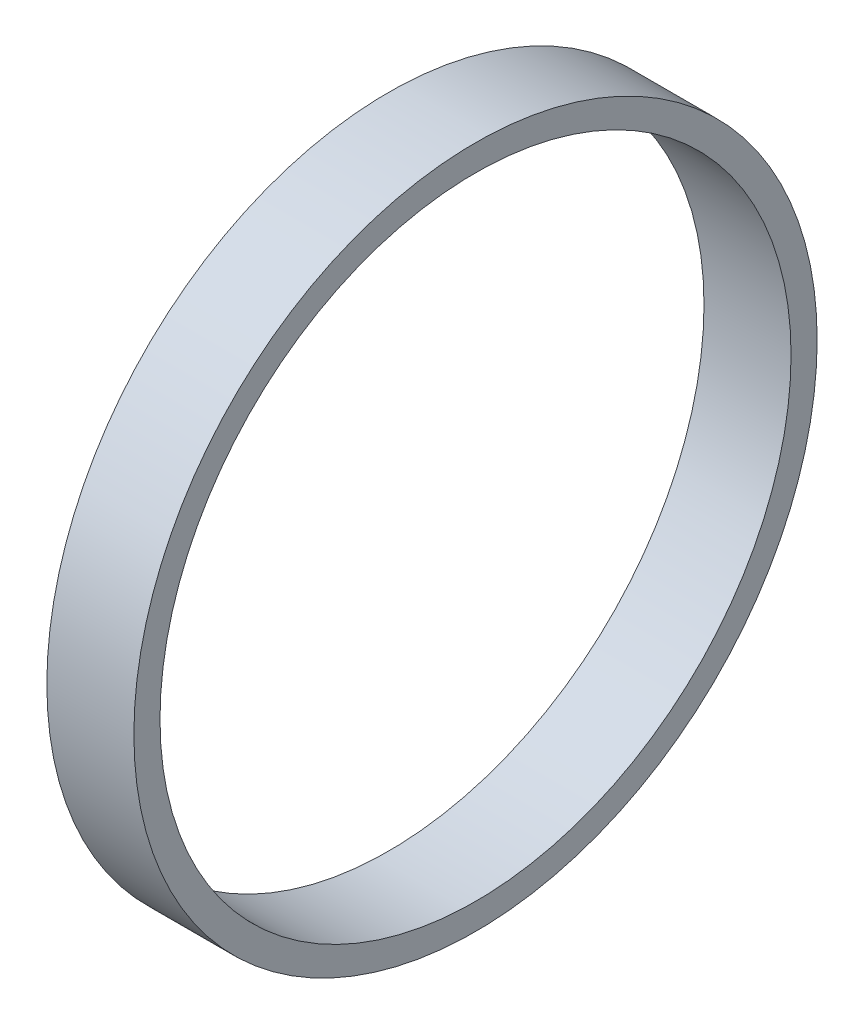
from build123d import *

# Parameters (mm, degrees)
ESQUISSE1_W = 8
ESQUISSE1_H = 2.4


with BuildPart() as part:
    # Esquisse1 → R_volution1 (revolve)
    with BuildSketch(Plane.XY, mode=Mode.PRIVATE) as r_volution1_sk:
        with Locations((4, 30.2)):
            Rectangle(ESQUISSE1_W, ESQUISSE1_H)
    revolve(r_volution1_sk.sketch.rotate(Axis((0, 0, 0), (1, 0, 0)), 90), axis=Axis((0, 0, 0), (1, 0, 0)))


solid = part.part
